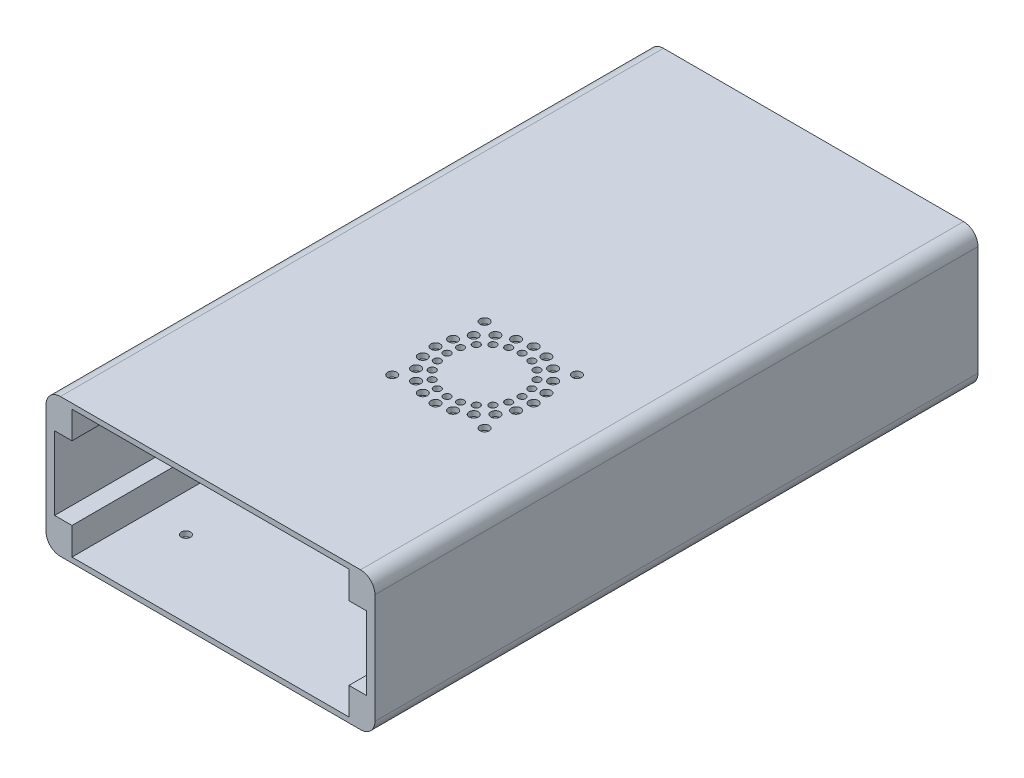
from build123d import *

# Parameters (mm, degrees)
BOSS_EXTRUDE1_DEPTH = 209
SKETCH2_R           = 1.6
SKETCH2_R_2         = 1.25
CUT_EXTRUDE1_DEPTH  = 1.8
SKETCH4_R           = 1.6
SKETCH4_R_2         = 2.25
CUT_EXTRUDE2_DEPTH  = 10


with BuildPart() as part:
    # Sketch1 → Boss-Extrude1 (new body)
    with BuildSketch(Plane.XY):
        with BuildLine():
            Line((-110.5, 1), (-6.5, 1))
            ThreePointArc((-6.5, 1), (-2.964466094, 2.464466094), (-1.5, 6))
            Line((-1.5, 6), (-1.5, 44))
            ThreePointArc((-1.5, 44), (-2.964466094, 47.535533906), (-6.5, 49))
            Line((-6.5, 49), (-110.5, 49))
            ThreePointArc((-110.5, 49), (-114.035533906, 47.535533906), (-115.5, 44))
            Line((-115.5, 44), (-115.5, 6))
            ThreePointArc((-115.5, 6), (-114.035533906, 2.464466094), (-110.5, 1))
        make_face()
        Polygon((-10.5, 2.8), (-10.5, 12.3), (-4.5, 12.3), (-4.5, 37.7), (-10.5, 37.7), (-10.5, 47.2), (-106.5, 47.2), (-106.5, 37.7), (-112.5, 37.7), (-112.5, 12.3), (-106.5, 12.3), (-106.5, 2.8), align=None, mode=Mode.SUBTRACT)
    extrude(amount=-BOSS_EXTRUDE1_DEPTH)

    # Sketch2 → Cut-Extrude1 (cut)
    with BuildSketch(Plane(origin=(0, 49, 0), x_dir=(1, 0, 0), z_dir=(0, 1, 0))):
        with Locations(Location((-59.5, 96, 0), (0, 0, 180))):
            Circle(SKETCH2_R)
        with Locations(Location((-27.5, 96, 0), (0, 0, 180))):
            Circle(SKETCH2_R)
        with Locations(Location((-27.5, 64, 0), (0, 0, 180))):
            Circle(SKETCH2_R)
        with Locations(Location((-59.5, 64, 0), (0, 0, 180))):
            Circle(SKETCH2_R)
        with Locations(Location((-60.5, 80, 0), (0, 0, 180))):
            Circle(SKETCH2_R)
        with Locations(Location((-56.5, 80, 0), (0, 0, 180))):
            Circle(SKETCH2_R_2)
        with Locations(Location((-59.667960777, 85.253288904, 0), (0, 0, 180))):
            Circle(SKETCH2_R)
        with Locations(Location((-55.863734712, 84.017220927, 0), (0, 0, 180))):
            Circle(SKETCH2_R_2)
        with Locations(Location((-57.253288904, 89.992349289, 0), (0, 0, 180))):
            Circle(SKETCH2_R)
        with Locations(Location((-54.017220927, 87.64120828, 0), (0, 0, 180))):
            Circle(SKETCH2_R_2)
        with Locations(Location((-53.492349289, 93.753288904, 0), (0, 0, 180))):
            Circle(SKETCH2_R)
        with Locations(Location((-51.14120828, 90.517220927, 0), (0, 0, 180))):
            Circle(SKETCH2_R_2)
        with Locations(Location((-48.753288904, 96.167960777, 0), (0, 0, 180))):
            Circle(SKETCH2_R)
        with Locations(Location((-47.517220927, 92.363734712, 0), (0, 0, 180))):
            Circle(SKETCH2_R_2)
        with Locations(Location((-43.5, 97, 0), (0, 0, 180))):
            Circle(SKETCH2_R)
        with Locations(Location((-43.5, 93, 0), (0, 0, 180))):
            Circle(SKETCH2_R_2)
        with Locations(Location((-38.246711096, 96.167960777, 0), (0, 0, 180))):
            Circle(SKETCH2_R)
        with Locations(Location((-39.482779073, 92.363734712, 0), (0, 0, 180))):
            Circle(SKETCH2_R_2)
        with Locations(Location((-33.507650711, 93.753288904, 0), (0, 0, 180))):
            Circle(SKETCH2_R)
        with Locations(Location((-35.85879172, 90.517220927, 0), (0, 0, 180))):
            Circle(SKETCH2_R_2)
        with Locations(Location((-29.746711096, 89.992349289, 0), (0, 0, 180))):
            Circle(SKETCH2_R)
        with Locations(Location((-32.982779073, 87.64120828, 0), (0, 0, 180))):
            Circle(SKETCH2_R_2)
        with Locations(Location((-27.332039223, 85.253288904, 0), (0, 0, 180))):
            Circle(SKETCH2_R)
        with Locations(Location((-31.136265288, 84.017220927, 0), (0, 0, 180))):
            Circle(SKETCH2_R_2)
        with Locations(Location((-26.5, 80, 0), (0, 0, 180))):
            Circle(SKETCH2_R)
        with Locations(Location((-30.5, 80, 0), (0, 0, 180))):
            Circle(SKETCH2_R_2)
        with Locations(Location((-27.332039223, 74.746711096, 0), (0, 0, 180))):
            Circle(SKETCH2_R)
        with Locations(Location((-31.136265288, 75.982779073, 0), (0, 0, 180))):
            Circle(SKETCH2_R_2)
        with Locations(Location((-29.746711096, 70.007650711, 0), (0, 0, 180))):
            Circle(SKETCH2_R)
        with Locations(Location((-32.982779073, 72.35879172, 0), (0, 0, 180))):
            Circle(SKETCH2_R_2)
        with Locations(Location((-33.507650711, 66.246711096, 0), (0, 0, 180))):
            Circle(SKETCH2_R)
        with Locations(Location((-35.85879172, 69.482779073, 0), (0, 0, 180))):
            Circle(SKETCH2_R_2)
        with Locations(Location((-38.246711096, 63.832039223, 0), (0, 0, 180))):
            Circle(SKETCH2_R)
        with Locations(Location((-39.482779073, 67.636265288, 0), (0, 0, 180))):
            Circle(SKETCH2_R_2)
        with Locations(Location((-43.5, 63, 0), (0, 0, 180))):
            Circle(SKETCH2_R)
        with Locations(Location((-43.5, 67, 0), (0, 0, 180))):
            Circle(SKETCH2_R_2)
        with Locations(Location((-48.753288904, 63.832039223, 0), (0, 0, 180))):
            Circle(SKETCH2_R)
        with Locations(Location((-47.517220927, 67.636265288, 0), (0, 0, 180))):
            Circle(SKETCH2_R_2)
        with Locations(Location((-53.492349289, 66.246711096, 0), (0, 0, 180))):
            Circle(SKETCH2_R)
        with Locations(Location((-51.14120828, 69.482779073, 0), (0, 0, 180))):
            Circle(SKETCH2_R_2)
        with Locations(Location((-57.253288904, 70.007650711, 0), (0, 0, 180))):
            Circle(SKETCH2_R)
        with Locations(Location((-54.017220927, 72.35879172, 0), (0, 0, 180))):
            Circle(SKETCH2_R_2)
        with Locations(Location((-59.667960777, 74.746711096, 0), (0, 0, 180))):
            Circle(SKETCH2_R)
        with Locations(Location((-55.863734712, 75.982779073, 0), (0, 0, 180))):
            Circle(SKETCH2_R_2)
    extrude(amount=-CUT_EXTRUDE1_DEPTH, mode=Mode.SUBTRACT)

    # Sketch4 → Cut-Extrude2 (cut)
    with BuildSketch(Plane.XZ.offset(-1)):
        with Locations((-16.5, -26.5)):
            Circle(SKETCH4_R)
        with Locations((-16.5, -103.5)):
            Circle(SKETCH4_R)
        with Locations((-93.5, -26.5)):
            Circle(SKETCH4_R)
        with Locations((-93.5, -103.5)):
            Circle(SKETCH4_R)
        with Locations((-65.5, -154)):
            Circle(SKETCH4_R_2)
    extrude(amount=-CUT_EXTRUDE2_DEPTH, mode=Mode.SUBTRACT)


solid = part.part
